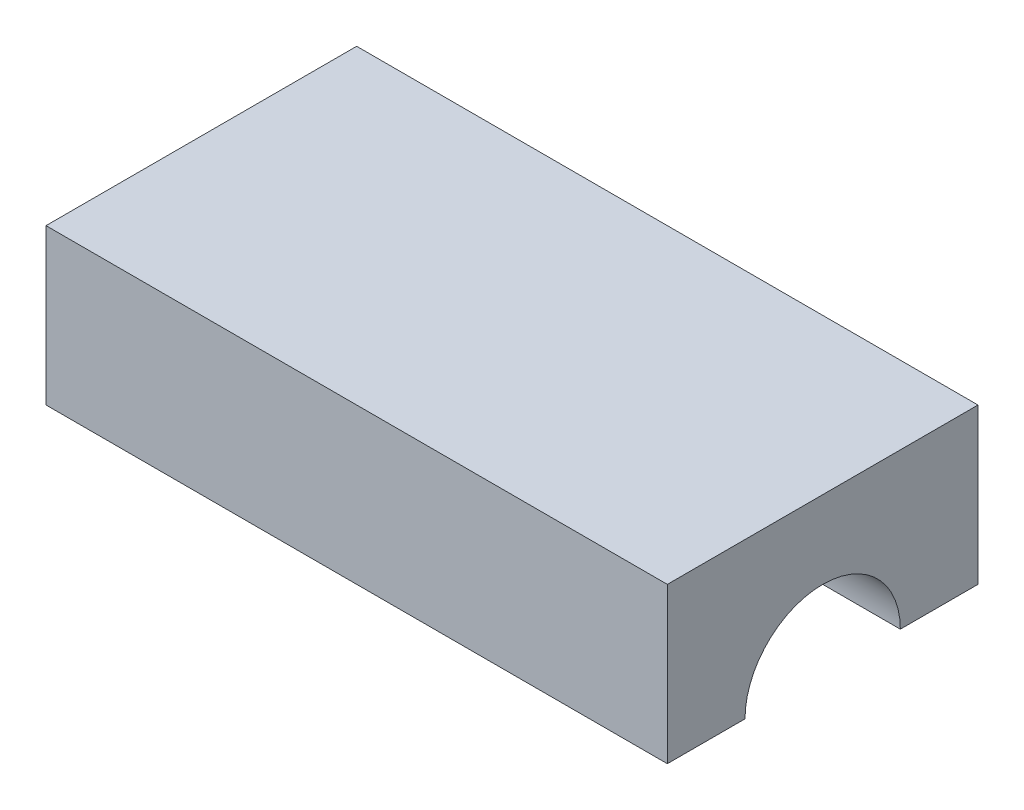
ISO-10303-21;
HEADER;
FILE_DESCRIPTION(('STEP AP214'),'2;1');
FILE_NAME('part.step','',(''),(''),'','','');
FILE_SCHEMA(('AUTOMOTIVE_DESIGN { 1 0 10303 214 1 1 1 1 }'));
ENDSEC;
DATA;
#1=APPLICATION_CONTEXT('core data for automotive mechanical design processes');
#2=APPLICATION_PROTOCOL_DEFINITION('international standard','automotive_design',2000,#1);
#3=PRODUCT_CONTEXT('',#1,'mechanical');
#4=PRODUCT('Part','Part','',(#3));
#5=PRODUCT_RELATED_PRODUCT_CATEGORY('part','',(#4));
#6=PRODUCT_DEFINITION_FORMATION('','',#4);
#7=PRODUCT_DEFINITION_CONTEXT('part definition',#1,'design');
#8=PRODUCT_DEFINITION('design','',#6,#7);
#9=PRODUCT_DEFINITION_SHAPE('','',#8);
#10=(LENGTH_UNIT() NAMED_UNIT(*) SI_UNIT(.MILLI.,.METRE.));
#11=(NAMED_UNIT(*) PLANE_ANGLE_UNIT() SI_UNIT($,.RADIAN.));
#12=(NAMED_UNIT(*) SI_UNIT($,.STERADIAN.) SOLID_ANGLE_UNIT());
#13=UNCERTAINTY_MEASURE_WITH_UNIT(LENGTH_MEASURE(1.E-05),#10,'distance_accuracy_value','');
#14=(GEOMETRIC_REPRESENTATION_CONTEXT(3) GLOBAL_UNCERTAINTY_ASSIGNED_CONTEXT((#13)) GLOBAL_UNIT_ASSIGNED_CONTEXT((#10,
#11,#12)) REPRESENTATION_CONTEXT('',''));
#15=CARTESIAN_POINT('',(0.,0.,0.));
#16=DIRECTION('',(0.,0.,1.));
#17=DIRECTION('',(1.,0.,0.));
#18=AXIS2_PLACEMENT_3D('',#15,#16,#17);
#19=CARTESIAN_POINT('',(0.,0.,0.));
#20=DIRECTION('',(0.,1.,0.));
#21=DIRECTION('',(0.,0.,1.));
#22=AXIS2_PLACEMENT_3D('',#19,#20,#21);
#23=PLANE('',#22);
#24=DIRECTION('',(-0.514495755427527,0.,-0.857492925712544));
#25=VECTOR('',#24,1.);
#26=CARTESIAN_POINT('',(53.34,0.,38.1));
#27=LINE('',#26,#25);
#28=CARTESIAN_POINT('',(53.34,0.,38.1));
#29=VERTEX_POINT('',#28);
#30=CARTESIAN_POINT('',(49.53,0.,31.75));
#31=VERTEX_POINT('',#30);
#32=EDGE_CURVE('E131',#29,#31,#27,.T.);
#33=ORIENTED_EDGE('',*,*,#32,.F.);
#34=DIRECTION('',(1.,0.,0.));
#35=VECTOR('',#34,1.);
#36=CARTESIAN_POINT('',(53.34,0.,38.1));
#37=LINE('',#36,#35);
#38=CARTESIAN_POINT('',(101.6,0.,38.1));
#39=VERTEX_POINT('',#38);
#40=EDGE_CURVE('E12',#29,#39,#37,.T.);
#41=ORIENTED_EDGE('',*,*,#40,.T.);
#42=DIRECTION('',(0.,0.,-1.));
#43=VECTOR('',#42,1.);
#44=CARTESIAN_POINT('',(101.6,0.,0.));
#45=LINE('',#44,#43);
#46=CARTESIAN_POINT('',(101.6,0.,50.8));
#47=VERTEX_POINT('',#46);
#48=EDGE_CURVE('E225',#47,#39,#45,.T.);
#49=ORIENTED_EDGE('',*,*,#48,.F.);
#50=DIRECTION('',(1.,0.,0.));
#51=VECTOR('',#50,1.);
#52=CARTESIAN_POINT('',(0.,0.,50.8));
#53=LINE('',#52,#51);
#54=CARTESIAN_POINT('',(0.,0.,50.8));
#55=VERTEX_POINT('',#54);
#56=EDGE_CURVE('E214',#55,#47,#53,.T.);
#57=ORIENTED_EDGE('',*,*,#56,.F.);
#58=DIRECTION('',(0.,0.,1.));
#59=VECTOR('',#58,1.);
#60=CARTESIAN_POINT('',(0.,0.,0.));
#61=LINE('',#60,#59);
#62=CARTESIAN_POINT('',(0.,0.,38.1));
#63=VERTEX_POINT('',#62);
#64=EDGE_CURVE('E257',#63,#55,#61,.T.);
#65=ORIENTED_EDGE('',*,*,#64,.F.);
#66=DIRECTION('',(-1.,0.,0.));
#67=VECTOR('',#66,1.);
#68=CARTESIAN_POINT('',(3.81,0.,38.1));
#69=LINE('',#68,#67);
#70=CARTESIAN_POINT('',(3.81,0.,38.1));
#71=VERTEX_POINT('',#70);
#72=EDGE_CURVE('E149',#63,#71,#69,.F.);
#73=ORIENTED_EDGE('',*,*,#72,.T.);
#74=DIRECTION('',(0.,0.,1.));
#75=VECTOR('',#74,1.);
#76=CARTESIAN_POINT('',(3.81,0.,0.));
#77=LINE('',#76,#75);
#78=CARTESIAN_POINT('',(3.81,0.,31.75));
#79=VERTEX_POINT('',#78);
#80=EDGE_CURVE('E243',#79,#71,#77,.T.);
#81=ORIENTED_EDGE('',*,*,#80,.F.);
#82=DIRECTION('',(-1.,0.,0.));
#83=VECTOR('',#82,1.);
#84=CARTESIAN_POINT('',(49.53,0.,31.75));
#85=LINE('',#84,#83);
#86=EDGE_CURVE('E55',#79,#31,#85,.F.);
#87=ORIENTED_EDGE('',*,*,#86,.T.);
#88=EDGE_LOOP('',(#33,#41,#49,#57,#65,#73,#81,#87));
#89=FACE_BOUND('',#88,.T.);
#90=ADVANCED_FACE('F39',(#89),#23,.F.);
#91=DIRECTION('',(-0.514495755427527,0.,0.857492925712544));
#92=VECTOR('',#91,1.);
#93=CARTESIAN_POINT('',(53.34,0.,12.7));
#94=LINE('',#93,#92);
#95=CARTESIAN_POINT('',(53.34,0.,12.7));
#96=VERTEX_POINT('',#95);
#97=CARTESIAN_POINT('',(49.53,0.,19.05));
#98=VERTEX_POINT('',#97);
#99=EDGE_CURVE('E118',#96,#98,#94,.T.);
#100=ORIENTED_EDGE('',*,*,#99,.T.);
#101=DIRECTION('',(-1.,0.,0.));
#102=VECTOR('',#101,1.);
#103=CARTESIAN_POINT('',(49.53,0.,19.05));
#104=LINE('',#103,#102);
#105=CARTESIAN_POINT('',(3.81,0.,19.05));
#106=VERTEX_POINT('',#105);
#107=EDGE_CURVE('E155',#98,#106,#104,.T.);
#108=ORIENTED_EDGE('',*,*,#107,.T.);
#109=CARTESIAN_POINT('',(3.81,0.,12.7));
#110=VERTEX_POINT('',#109);
#111=EDGE_CURVE('E244',#110,#106,#77,.T.);
#112=ORIENTED_EDGE('',*,*,#111,.F.);
#113=DIRECTION('',(-1.,0.,0.));
#114=VECTOR('',#113,1.);
#115=CARTESIAN_POINT('',(3.81,0.,12.7));
#116=LINE('',#115,#114);
#117=CARTESIAN_POINT('',(0.,0.,12.7));
#118=VERTEX_POINT('',#117);
#119=EDGE_CURVE('E146',#110,#118,#116,.T.);
#120=ORIENTED_EDGE('',*,*,#119,.T.);
#121=CARTESIAN_POINT('',(0.,0.,0.));
#122=VERTEX_POINT('',#121);
#123=EDGE_CURVE('E222',#122,#118,#61,.T.);
#124=ORIENTED_EDGE('',*,*,#123,.F.);
#125=DIRECTION('',(-1.,0.,0.));
#126=VECTOR('',#125,1.);
#127=CARTESIAN_POINT('',(0.,0.,0.));
#128=LINE('',#127,#126);
#129=CARTESIAN_POINT('',(101.6,0.,0.));
#130=VERTEX_POINT('',#129);
#131=EDGE_CURVE('E230',#130,#122,#128,.T.);
#132=ORIENTED_EDGE('',*,*,#131,.F.);
#133=CARTESIAN_POINT('',(101.6,0.,12.7));
#134=VERTEX_POINT('',#133);
#135=EDGE_CURVE('E145',#134,#130,#45,.T.);
#136=ORIENTED_EDGE('',*,*,#135,.F.);
#137=DIRECTION('',(1.,0.,0.));
#138=VECTOR('',#137,1.);
#139=CARTESIAN_POINT('',(53.34,0.,12.7));
#140=LINE('',#139,#138);
#141=EDGE_CURVE('E48',#134,#96,#140,.F.);
#142=ORIENTED_EDGE('',*,*,#141,.T.);
#143=EDGE_LOOP('',(#100,#108,#112,#120,#124,#132,#136,#142));
#144=FACE_BOUND('',#143,.T.);
#145=ADVANCED_FACE('F143',(#144),#23,.F.);
#146=CARTESIAN_POINT('',(0.,25.4,0.));
#147=DIRECTION('',(1.,0.,0.));
#148=DIRECTION('',(0.,0.,-1.));
#149=AXIS2_PLACEMENT_3D('',#146,#147,#148);
#150=PLANE('',#149);
#151=ORIENTED_EDGE('',*,*,#123,.T.);
#152=CARTESIAN_POINT('',(0.,0.,25.4));
#153=DIRECTION('',(-1.,0.,0.));
#154=DIRECTION('',(0.,0.,1.));
#155=AXIS2_PLACEMENT_3D('',#152,#153,#154);
#156=CIRCLE('',#155,12.7);
#157=EDGE_CURVE('E138',#63,#118,#156,.T.);
#158=ORIENTED_EDGE('',*,*,#157,.F.);
#159=ORIENTED_EDGE('',*,*,#64,.T.);
#160=DIRECTION('',(0.,-1.,0.));
#161=VECTOR('',#160,1.);
#162=CARTESIAN_POINT('',(0.,25.4,50.8));
#163=LINE('',#162,#161);
#164=CARTESIAN_POINT('',(0.,25.4,50.8));
#165=VERTEX_POINT('',#164);
#166=EDGE_CURVE('E219',#165,#55,#163,.T.);
#167=ORIENTED_EDGE('',*,*,#166,.F.);
#168=DIRECTION('',(0.,0.,1.));
#169=VECTOR('',#168,1.);
#170=CARTESIAN_POINT('',(0.,25.4,0.));
#171=LINE('',#170,#169);
#172=CARTESIAN_POINT('',(0.,25.4,0.));
#173=VERTEX_POINT('',#172);
#174=EDGE_CURVE('E232',#173,#165,#171,.T.);
#175=ORIENTED_EDGE('',*,*,#174,.F.);
#176=DIRECTION('',(0.,-1.,0.));
#177=VECTOR('',#176,1.);
#178=CARTESIAN_POINT('',(0.,25.4,0.));
#179=LINE('',#178,#177);
#180=EDGE_CURVE('E236',#173,#122,#179,.T.);
#181=ORIENTED_EDGE('',*,*,#180,.T.);
#182=EDGE_LOOP('',(#151,#158,#159,#167,#175,#181));
#183=FACE_BOUND('',#182,.T.);
#184=ADVANCED_FACE('F41',(#183),#150,.F.);
#185=CARTESIAN_POINT('',(0.,25.4,50.8));
#186=DIRECTION('',(0.,0.,-1.));
#187=DIRECTION('',(-1.,0.,0.));
#188=AXIS2_PLACEMENT_3D('',#185,#186,#187);
#189=PLANE('',#188);
#190=ORIENTED_EDGE('',*,*,#56,.T.);
#191=DIRECTION('',(0.,-1.,0.));
#192=VECTOR('',#191,1.);
#193=CARTESIAN_POINT('',(101.6,25.4,50.8));
#194=LINE('',#193,#192);
#195=CARTESIAN_POINT('',(101.6,25.4,50.8));
#196=VERTEX_POINT('',#195);
#197=EDGE_CURVE('E216',#196,#47,#194,.T.);
#198=ORIENTED_EDGE('',*,*,#197,.F.);
#199=DIRECTION('',(1.,0.,0.));
#200=VECTOR('',#199,1.);
#201=CARTESIAN_POINT('',(0.,25.4,50.8));
#202=LINE('',#201,#200);
#203=EDGE_CURVE('E261',#165,#196,#202,.T.);
#204=ORIENTED_EDGE('',*,*,#203,.F.);
#205=ORIENTED_EDGE('',*,*,#166,.T.);
#206=EDGE_LOOP('',(#190,#198,#204,#205));
#207=FACE_BOUND('',#206,.T.);
#208=ADVANCED_FACE('F203',(#207),#189,.F.);
#209=CARTESIAN_POINT('',(101.6,25.4,0.));
#210=DIRECTION('',(-1.,0.,0.));
#211=DIRECTION('',(0.,0.,1.));
#212=AXIS2_PLACEMENT_3D('',#209,#210,#211);
#213=PLANE('',#212);
#214=ORIENTED_EDGE('',*,*,#48,.T.);
#215=CARTESIAN_POINT('',(101.6,0.,25.4));
#216=DIRECTION('',(1.,0.,0.));
#217=DIRECTION('',(0.,0.,-1.));
#218=AXIS2_PLACEMENT_3D('',#215,#216,#217);
#219=CIRCLE('',#218,12.7);
#220=EDGE_CURVE('E139',#134,#39,#219,.T.);
#221=ORIENTED_EDGE('',*,*,#220,.F.);
#222=ORIENTED_EDGE('',*,*,#135,.T.);
#223=DIRECTION('',(0.,-1.,0.));
#224=VECTOR('',#223,1.);
#225=CARTESIAN_POINT('',(101.6,25.4,0.));
#226=LINE('',#225,#224);
#227=CARTESIAN_POINT('',(101.6,25.4,0.));
#228=VERTEX_POINT('',#227);
#229=EDGE_CURVE('E228',#228,#130,#226,.T.);
#230=ORIENTED_EDGE('',*,*,#229,.F.);
#231=DIRECTION('',(0.,0.,-1.));
#232=VECTOR('',#231,1.);
#233=CARTESIAN_POINT('',(101.6,25.4,0.));
#234=LINE('',#233,#232);
#235=EDGE_CURVE('E227',#196,#228,#234,.T.);
#236=ORIENTED_EDGE('',*,*,#235,.F.);
#237=ORIENTED_EDGE('',*,*,#197,.T.);
#238=EDGE_LOOP('',(#214,#221,#222,#230,#236,#237));
#239=FACE_BOUND('',#238,.T.);
#240=ADVANCED_FACE('F200',(#239),#213,.F.);
#241=CARTESIAN_POINT('',(0.,25.4,0.));
#242=DIRECTION('',(0.,0.,1.));
#243=DIRECTION('',(1.,0.,0.));
#244=AXIS2_PLACEMENT_3D('',#241,#242,#243);
#245=PLANE('',#244);
#246=ORIENTED_EDGE('',*,*,#131,.T.);
#247=ORIENTED_EDGE('',*,*,#180,.F.);
#248=DIRECTION('',(-1.,0.,0.));
#249=VECTOR('',#248,1.);
#250=CARTESIAN_POINT('',(0.,25.4,0.));
#251=LINE('',#250,#249);
#252=EDGE_CURVE('E239',#228,#173,#251,.T.);
#253=ORIENTED_EDGE('',*,*,#252,.F.);
#254=ORIENTED_EDGE('',*,*,#229,.T.);
#255=EDGE_LOOP('',(#246,#247,#253,#254));
#256=FACE_BOUND('',#255,.T.);
#257=ADVANCED_FACE('F193',(#256),#245,.F.);
#258=CARTESIAN_POINT('',(0.,25.4,0.));
#259=DIRECTION('',(0.,1.,0.));
#260=DIRECTION('',(0.,0.,1.));
#261=AXIS2_PLACEMENT_3D('',#258,#259,#260);
#262=PLANE('',#261);
#263=ORIENTED_EDGE('',*,*,#174,.T.);
#264=ORIENTED_EDGE('',*,*,#203,.T.);
#265=ORIENTED_EDGE('',*,*,#235,.T.);
#266=ORIENTED_EDGE('',*,*,#252,.T.);
#267=EDGE_LOOP('',(#263,#264,#265,#266));
#268=FACE_BOUND('',#267,.T.);
#269=ADVANCED_FACE('F189',(#268),#262,.T.);
#270=CARTESIAN_POINT('',(3.81,0.,25.4));
#271=DIRECTION('',(-1.,0.,0.));
#272=DIRECTION('',(0.,0.,1.));
#273=AXIS2_PLACEMENT_3D('',#270,#271,#272);
#274=CYLINDRICAL_SURFACE('',#273,12.7);
#275=CARTESIAN_POINT('',(3.81,0.,25.4));
#276=DIRECTION('',(-1.,0.,0.));
#277=DIRECTION('',(0.,0.,1.));
#278=AXIS2_PLACEMENT_3D('',#275,#276,#277);
#279=CIRCLE('',#278,12.7);
#280=EDGE_CURVE('E63',#71,#110,#279,.T.);
#281=ORIENTED_EDGE('',*,*,#280,.F.);
#282=ORIENTED_EDGE('',*,*,#72,.F.);
#283=ORIENTED_EDGE('',*,*,#157,.T.);
#284=ORIENTED_EDGE('',*,*,#119,.F.);
#285=EDGE_LOOP('',(#281,#282,#283,#284));
#286=FACE_BOUND('',#285,.T.);
#287=ADVANCED_FACE('F186',(#286),#274,.F.);
#288=CARTESIAN_POINT('',(3.81,0.,25.4));
#289=DIRECTION('',(-1.,0.,0.));
#290=DIRECTION('',(0.,0.,1.));
#291=AXIS2_PLACEMENT_3D('',#288,#289,#290);
#292=PLANE('',#291);
#293=CARTESIAN_POINT('',(3.81,0.,25.4));
#294=DIRECTION('',(-1.,0.,0.));
#295=DIRECTION('',(0.,0.,1.));
#296=AXIS2_PLACEMENT_3D('',#293,#294,#295);
#297=CIRCLE('',#296,6.35);
#298=EDGE_CURVE('E130',#79,#106,#297,.T.);
#299=ORIENTED_EDGE('',*,*,#298,.F.);
#300=ORIENTED_EDGE('',*,*,#80,.T.);
#301=ORIENTED_EDGE('',*,*,#280,.T.);
#302=ORIENTED_EDGE('',*,*,#111,.T.);
#303=EDGE_LOOP('',(#299,#300,#301,#302));
#304=FACE_BOUND('',#303,.T.);
#305=ADVANCED_FACE('F176',(#304),#292,.T.);
#306=CARTESIAN_POINT('',(53.34,0.,25.4));
#307=DIRECTION('',(1.,0.,0.));
#308=DIRECTION('',(0.,0.,-1.));
#309=AXIS2_PLACEMENT_3D('',#306,#307,#308);
#310=CYLINDRICAL_SURFACE('',#309,12.7);
#311=CARTESIAN_POINT('',(53.34,0.,25.4));
#312=DIRECTION('',(1.,0.,0.));
#313=DIRECTION('',(0.,0.,-1.));
#314=AXIS2_PLACEMENT_3D('',#311,#312,#313);
#315=CIRCLE('',#314,12.7);
#316=EDGE_CURVE('E121',#96,#29,#315,.T.);
#317=ORIENTED_EDGE('',*,*,#316,.F.);
#318=ORIENTED_EDGE('',*,*,#141,.F.);
#319=ORIENTED_EDGE('',*,*,#220,.T.);
#320=ORIENTED_EDGE('',*,*,#40,.F.);
#321=EDGE_LOOP('',(#317,#318,#319,#320));
#322=FACE_BOUND('',#321,.T.);
#323=ADVANCED_FACE('F136',(#322),#310,.F.);
#324=CARTESIAN_POINT('',(49.53,0.,25.4));
#325=DIRECTION('',(-1.,0.,0.));
#326=DIRECTION('',(0.,0.,1.));
#327=AXIS2_PLACEMENT_3D('',#324,#325,#326);
#328=CYLINDRICAL_SURFACE('',#327,6.35);
#329=CARTESIAN_POINT('',(49.53,0.,25.4));
#330=DIRECTION('',(-1.,0.,0.));
#331=DIRECTION('',(0.,0.,1.));
#332=AXIS2_PLACEMENT_3D('',#329,#330,#331);
#333=CIRCLE('',#332,6.35);
#334=EDGE_CURVE('E124',#31,#98,#333,.T.);
#335=ORIENTED_EDGE('',*,*,#334,.F.);
#336=ORIENTED_EDGE('',*,*,#86,.F.);
#337=ORIENTED_EDGE('',*,*,#298,.T.);
#338=ORIENTED_EDGE('',*,*,#107,.F.);
#339=EDGE_LOOP('',(#335,#336,#337,#338));
#340=FACE_BOUND('',#339,.T.);
#341=ADVANCED_FACE('F162',(#340),#328,.F.);
#342=CARTESIAN_POINT('',(53.34,0.,25.4));
#343=DIRECTION('',(1.,0.,0.));
#344=DIRECTION('',(0.,0.,-1.));
#345=AXIS2_PLACEMENT_3D('',#342,#343,#344);
#346=CONICAL_SURFACE('',#345,12.7,1.03037682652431);
#347=ORIENTED_EDGE('',*,*,#99,.F.);
#348=ORIENTED_EDGE('',*,*,#316,.T.);
#349=ORIENTED_EDGE('',*,*,#32,.T.);
#350=ORIENTED_EDGE('',*,*,#334,.T.);
#351=EDGE_LOOP('',(#347,#348,#349,#350));
#352=FACE_BOUND('',#351,.T.);
#353=ADVANCED_FACE('F120',(#352),#346,.F.);
#354=CLOSED_SHELL('',(#90,#145,#184,#208,#240,#257,#269,#287,#305,#323,#341,#353));
#355=MANIFOLD_SOLID_BREP('B2',#354);
#356=ADVANCED_BREP_SHAPE_REPRESENTATION('',(#18,#355),#14);
#357=SHAPE_DEFINITION_REPRESENTATION(#9,#356);
ENDSEC;
END-ISO-10303-21;
